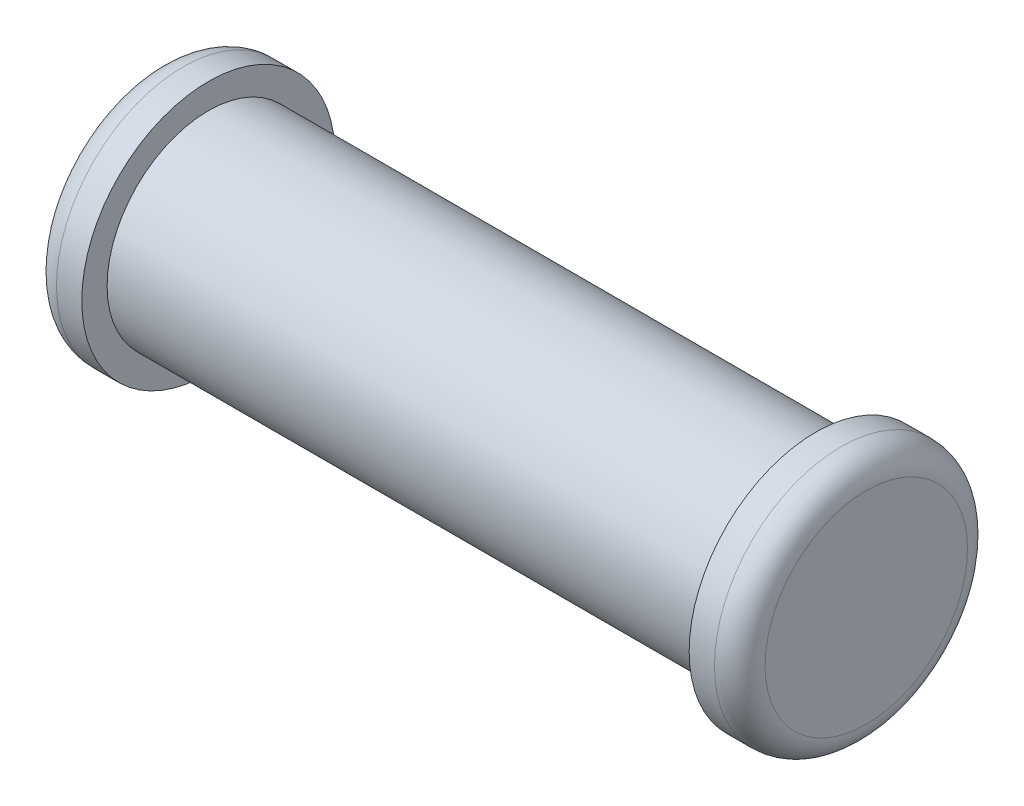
from build123d import *

# Parameters (mm, degrees)
SKETCH1_R            = 2
BOSS_EXTRUDE1_DEPTH  = 12
SKETCH2_R            = 2.5
BOSS_EXTRUDE2_DEPTH  = 1
FILLET1_R            = 0.5
FILLET1_OF_MIRROR1_R = 0.5


with BuildPart() as part:
    # Sketch1 → Boss-Extrude1 (new body)
    with BuildSketch(Plane(origin=(0, 0, 0), x_dir=(0, 0, -1), z_dir=(1, 0, 0))):
        Circle(SKETCH1_R)
    extrude(amount=BOSS_EXTRUDE1_DEPTH)

    # Sketch2 → Boss-Extrude2 (add)
    with BuildSketch(Plane.ZY):
        Circle(SKETCH2_R)
    boss_extrude2 = extrude(amount=BOSS_EXTRUDE2_DEPTH)

    # Fillet1
    fillet1_edges = [part.edges().sort_by_distance(p)[0] for p in [
        (-1, 0, -2.5),
    ]]
    fillet(fillet1_edges, radius=FILLET1_R)

    # Mirror1: Boss-Extrude2 across plane
    add(boss_extrude2.mirror(Plane(origin=(6, 0, 0), x_dir=(0, 0, 1), z_dir=(1, 0, 0))))

    # Fillet1 of Mirror1
    fillet1_of_mirror1_edges = [part.edges().sort_by_distance(p)[0] for p in [
        (13, 0, -2.5),
    ]]
    fillet(fillet1_of_mirror1_edges, radius=FILLET1_OF_MIRROR1_R)


solid = part.part
